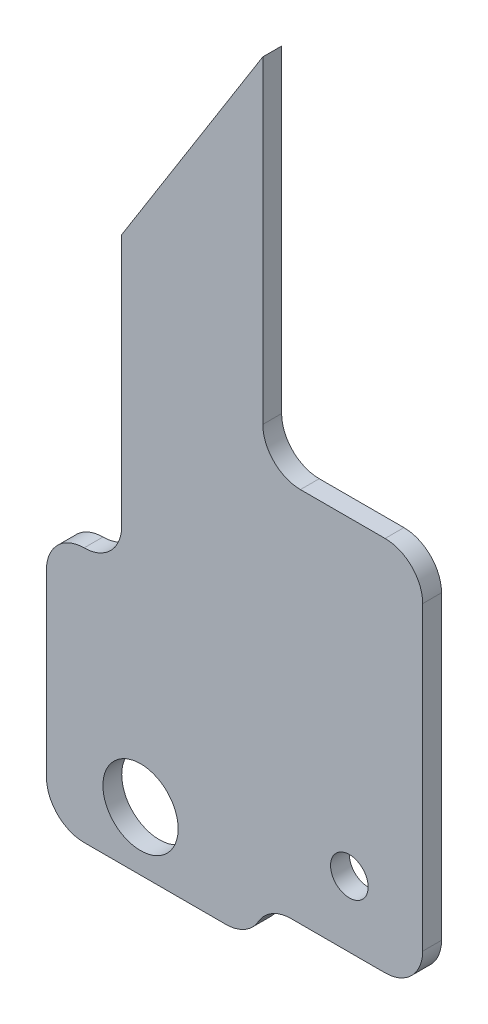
ISO-10303-21;
HEADER;
FILE_DESCRIPTION(('STEP AP214'),'2;1');
FILE_NAME('part.step','',(''),(''),'','','');
FILE_SCHEMA(('AUTOMOTIVE_DESIGN { 1 0 10303 214 1 1 1 1 }'));
ENDSEC;
DATA;
#1=APPLICATION_CONTEXT('core data for automotive mechanical design processes');
#2=APPLICATION_PROTOCOL_DEFINITION('international standard','automotive_design',2000,#1);
#3=PRODUCT_CONTEXT('',#1,'mechanical');
#4=PRODUCT('Part','Part','',(#3));
#5=PRODUCT_RELATED_PRODUCT_CATEGORY('part','',(#4));
#6=PRODUCT_DEFINITION_FORMATION('','',#4);
#7=PRODUCT_DEFINITION_CONTEXT('part definition',#1,'design');
#8=PRODUCT_DEFINITION('design','',#6,#7);
#9=PRODUCT_DEFINITION_SHAPE('','',#8);
#10=(LENGTH_UNIT() NAMED_UNIT(*) SI_UNIT(.MILLI.,.METRE.));
#11=(NAMED_UNIT(*) PLANE_ANGLE_UNIT() SI_UNIT($,.RADIAN.));
#12=(NAMED_UNIT(*) SI_UNIT($,.STERADIAN.) SOLID_ANGLE_UNIT());
#13=UNCERTAINTY_MEASURE_WITH_UNIT(LENGTH_MEASURE(1.E-05),#10,'distance_accuracy_value','');
#14=(GEOMETRIC_REPRESENTATION_CONTEXT(3) GLOBAL_UNCERTAINTY_ASSIGNED_CONTEXT((#13)) GLOBAL_UNIT_ASSIGNED_CONTEXT((#10,
#11,#12)) REPRESENTATION_CONTEXT('',''));
#15=CARTESIAN_POINT('',(0.,0.,0.));
#16=DIRECTION('',(0.,0.,1.));
#17=DIRECTION('',(1.,0.,0.));
#18=AXIS2_PLACEMENT_3D('',#15,#16,#17);
#19=CARTESIAN_POINT('',(-12.6488212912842,16.8678571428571,2.));
#20=DIRECTION('',(-1.,0.,0.));
#21=DIRECTION('',(0.,-1.,0.));
#22=AXIS2_PLACEMENT_3D('',#19,#20,#21);
#23=PLANE('',#22);
#24=DIRECTION('',(0.,1.,0.));
#25=VECTOR('',#24,1.);
#26=CARTESIAN_POINT('',(-12.6488212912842,16.8678571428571,2.));
#27=LINE('',#26,#25);
#28=CARTESIAN_POINT('',(-12.6488212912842,20.8678571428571,2.));
#29=VERTEX_POINT('',#28);
#30=CARTESIAN_POINT('',(-12.6488212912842,54.7093537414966,2.));
#31=VERTEX_POINT('',#30);
#32=EDGE_CURVE('E148',#29,#31,#27,.T.);
#33=ORIENTED_EDGE('',*,*,#32,.F.);
#34=DIRECTION('',(0.,0.,-1.));
#35=VECTOR('',#34,1.);
#36=CARTESIAN_POINT('',(-12.6488212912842,20.8678571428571,0.));
#37=LINE('',#36,#35);
#38=CARTESIAN_POINT('',(-12.6488212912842,20.8678571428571,0.));
#39=VERTEX_POINT('',#38);
#40=EDGE_CURVE('E176',#29,#39,#37,.T.);
#41=ORIENTED_EDGE('',*,*,#40,.T.);
#42=DIRECTION('',(0.,1.,0.));
#43=VECTOR('',#42,1.);
#44=CARTESIAN_POINT('',(-12.6488212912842,16.8678571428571,0.));
#45=LINE('',#44,#43);
#46=CARTESIAN_POINT('',(-12.6488212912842,54.7093537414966,0.));
#47=VERTEX_POINT('',#46);
#48=EDGE_CURVE('E174',#39,#47,#45,.T.);
#49=ORIENTED_EDGE('',*,*,#48,.T.);
#50=DIRECTION('',(0.,0.,-1.));
#51=VECTOR('',#50,1.);
#52=CARTESIAN_POINT('',(-12.6488212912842,54.7093537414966,2.));
#53=LINE('',#52,#51);
#54=EDGE_CURVE('E167',#31,#47,#53,.T.);
#55=ORIENTED_EDGE('',*,*,#54,.F.);
#56=EDGE_LOOP('',(#33,#41,#49,#55));
#57=FACE_BOUND('',#56,.T.);
#58=ADVANCED_FACE('F33',(#57),#23,.F.);
#59=CARTESIAN_POINT('',(-27.6488212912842,30.8428571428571,2.));
#60=DIRECTION('',(0.846665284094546,-0.532125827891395,0.));
#61=DIRECTION('',(0.532125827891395,0.846665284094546,0.));
#62=AXIS2_PLACEMENT_3D('',#59,#60,#61);
#63=PLANE('',#62);
#64=DIRECTION('',(-0.532125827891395,-0.846665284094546,0.));
#65=VECTOR('',#64,1.);
#66=CARTESIAN_POINT('',(-27.6488212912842,30.8428571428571,0.));
#67=LINE('',#66,#65);
#68=CARTESIAN_POINT('',(-27.6488212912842,30.8428571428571,0.));
#69=VERTEX_POINT('',#68);
#70=EDGE_CURVE('E291',#47,#69,#67,.T.);
#71=ORIENTED_EDGE('',*,*,#70,.T.);
#72=DIRECTION('',(0.,0.,-1.));
#73=VECTOR('',#72,1.);
#74=CARTESIAN_POINT('',(-27.6488212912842,30.8428571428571,2.));
#75=LINE('',#74,#73);
#76=CARTESIAN_POINT('',(-27.6488212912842,30.8428571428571,2.));
#77=VERTEX_POINT('',#76);
#78=EDGE_CURVE('E169',#77,#69,#75,.T.);
#79=ORIENTED_EDGE('',*,*,#78,.F.);
#80=DIRECTION('',(-0.532125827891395,-0.846665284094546,0.));
#81=VECTOR('',#80,1.);
#82=CARTESIAN_POINT('',(-27.6488212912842,30.8428571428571,2.));
#83=LINE('',#82,#81);
#84=EDGE_CURVE('E153',#31,#77,#83,.T.);
#85=ORIENTED_EDGE('',*,*,#84,.F.);
#86=ORIENTED_EDGE('',*,*,#54,.T.);
#87=EDGE_LOOP('',(#71,#79,#85,#86));
#88=FACE_BOUND('',#87,.T.);
#89=ADVANCED_FACE('F166',(#88),#63,.F.);
#90=CARTESIAN_POINT('',(-27.6488212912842,0.,2.));
#91=DIRECTION('',(1.,0.,0.));
#92=DIRECTION('',(0.,0.,-1.));
#93=AXIS2_PLACEMENT_3D('',#90,#91,#92);
#94=PLANE('',#93);
#95=DIRECTION('',(0.,-1.,0.));
#96=VECTOR('',#95,1.);
#97=CARTESIAN_POINT('',(-27.6488212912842,0.,0.));
#98=LINE('',#97,#96);
#99=CARTESIAN_POINT('',(-27.6488212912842,4.,0.));
#100=VERTEX_POINT('',#99);
#101=EDGE_CURVE('E278',#69,#100,#98,.T.);
#102=ORIENTED_EDGE('',*,*,#101,.T.);
#103=DIRECTION('',(0.,0.,-1.));
#104=VECTOR('',#103,1.);
#105=CARTESIAN_POINT('',(-27.6488212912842,4.,2.));
#106=LINE('',#105,#104);
#107=CARTESIAN_POINT('',(-27.6488212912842,4.,2.));
#108=VERTEX_POINT('',#107);
#109=EDGE_CURVE('E220',#100,#108,#106,.F.);
#110=ORIENTED_EDGE('',*,*,#109,.T.);
#111=DIRECTION('',(0.,-1.,0.));
#112=VECTOR('',#111,1.);
#113=CARTESIAN_POINT('',(-27.6488212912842,0.,2.));
#114=LINE('',#113,#112);
#115=EDGE_CURVE('E171',#77,#108,#114,.T.);
#116=ORIENTED_EDGE('',*,*,#115,.F.);
#117=ORIENTED_EDGE('',*,*,#78,.T.);
#118=EDGE_LOOP('',(#102,#110,#116,#117));
#119=FACE_BOUND('',#118,.T.);
#120=ADVANCED_FACE('F299',(#119),#94,.F.);
#121=CARTESIAN_POINT('',(-35.6488212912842,-52.8734693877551,2.));
#122=DIRECTION('',(1.,0.,0.));
#123=DIRECTION('',(0.,0.,-1.));
#124=AXIS2_PLACEMENT_3D('',#121,#122,#123);
#125=PLANE('',#124);
#126=DIRECTION('',(0.,-1.,0.));
#127=VECTOR('',#126,1.);
#128=CARTESIAN_POINT('',(-35.6488212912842,-52.8734693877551,0.));
#129=LINE('',#128,#127);
#130=CARTESIAN_POINT('',(-35.6488212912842,-4.,0.));
#131=VERTEX_POINT('',#130);
#132=CARTESIAN_POINT('',(-35.6488212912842,-23.1321428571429,0.));
#133=VERTEX_POINT('',#132);
#134=EDGE_CURVE('E274',#131,#133,#129,.T.);
#135=ORIENTED_EDGE('',*,*,#134,.T.);
#136=DIRECTION('',(0.,0.,1.));
#137=VECTOR('',#136,1.);
#138=CARTESIAN_POINT('',(-35.6488212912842,-23.1321428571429,2.));
#139=LINE('',#138,#137);
#140=CARTESIAN_POINT('',(-35.6488212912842,-23.1321428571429,2.));
#141=VERTEX_POINT('',#140);
#142=EDGE_CURVE('E11',#133,#141,#139,.T.);
#143=ORIENTED_EDGE('',*,*,#142,.T.);
#144=DIRECTION('',(0.,-1.,0.));
#145=VECTOR('',#144,1.);
#146=CARTESIAN_POINT('',(-35.6488212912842,-52.8734693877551,2.));
#147=LINE('',#146,#145);
#148=CARTESIAN_POINT('',(-35.6488212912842,-4.,2.));
#149=VERTEX_POINT('',#148);
#150=EDGE_CURVE('E314',#149,#141,#147,.T.);
#151=ORIENTED_EDGE('',*,*,#150,.F.);
#152=DIRECTION('',(0.,0.,-1.));
#153=VECTOR('',#152,1.);
#154=CARTESIAN_POINT('',(-35.6488212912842,-4.,2.));
#155=LINE('',#154,#153);
#156=EDGE_CURVE('E218',#149,#131,#155,.T.);
#157=ORIENTED_EDGE('',*,*,#156,.T.);
#158=EDGE_LOOP('',(#135,#143,#151,#157));
#159=FACE_BOUND('',#158,.T.);
#160=ADVANCED_FACE('F312',(#159),#125,.F.);
#161=CARTESIAN_POINT('',(-13.6488212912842,-23.1321428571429,2.));
#162=DIRECTION('',(0.,1.,0.));
#163=DIRECTION('',(0.,0.,1.));
#164=AXIS2_PLACEMENT_3D('',#161,#162,#163);
#165=PLANE('',#164);
#166=DIRECTION('',(1.,0.,0.));
#167=VECTOR('',#166,1.);
#168=CARTESIAN_POINT('',(-13.6488212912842,-23.1321428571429,0.));
#169=LINE('',#168,#167);
#170=CARTESIAN_POINT('',(-9.64882129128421,-23.1321428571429,0.));
#171=VERTEX_POINT('',#170);
#172=CARTESIAN_POINT('',(0.351178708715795,-23.1321428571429,0.));
#173=VERTEX_POINT('',#172);
#174=EDGE_CURVE('E269',#171,#173,#169,.T.);
#175=ORIENTED_EDGE('',*,*,#174,.T.);
#176=DIRECTION('',(0.,0.,-1.));
#177=VECTOR('',#176,1.);
#178=CARTESIAN_POINT('',(0.351178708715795,-23.1321428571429,2.));
#179=LINE('',#178,#177);
#180=CARTESIAN_POINT('',(0.351178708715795,-23.1321428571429,2.));
#181=VERTEX_POINT('',#180);
#182=EDGE_CURVE('E216',#173,#181,#179,.F.);
#183=ORIENTED_EDGE('',*,*,#182,.T.);
#184=DIRECTION('',(1.,0.,0.));
#185=VECTOR('',#184,1.);
#186=CARTESIAN_POINT('',(-13.6488212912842,-23.1321428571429,2.));
#187=LINE('',#186,#185);
#188=CARTESIAN_POINT('',(-9.64882129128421,-23.1321428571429,2.));
#189=VERTEX_POINT('',#188);
#190=EDGE_CURVE('E271',#189,#181,#187,.T.);
#191=ORIENTED_EDGE('',*,*,#190,.F.);
#192=DIRECTION('',(0.,0.,-1.));
#193=VECTOR('',#192,1.);
#194=CARTESIAN_POINT('',(-9.64882129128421,-23.1321428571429,0.));
#195=LINE('',#194,#193);
#196=EDGE_CURVE('E213',#189,#171,#195,.T.);
#197=ORIENTED_EDGE('',*,*,#196,.T.);
#198=EDGE_LOOP('',(#175,#183,#191,#197));
#199=FACE_BOUND('',#198,.T.);
#200=ADVANCED_FACE('F268',(#199),#165,.F.);
#201=CARTESIAN_POINT('',(4.3511787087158,-23.1321428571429,2.));
#202=DIRECTION('',(-1.,0.,0.));
#203=DIRECTION('',(0.,0.,1.));
#204=AXIS2_PLACEMENT_3D('',#201,#202,#203);
#205=PLANE('',#204);
#206=DIRECTION('',(0.,1.,0.));
#207=VECTOR('',#206,1.);
#208=CARTESIAN_POINT('',(4.3511787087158,-23.1321428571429,0.));
#209=LINE('',#208,#207);
#210=CARTESIAN_POINT('',(4.3511787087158,-19.1321428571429,0.));
#211=VERTEX_POINT('',#210);
#212=CARTESIAN_POINT('',(4.3511787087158,12.8678571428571,0.));
#213=VERTEX_POINT('',#212);
#214=EDGE_CURVE('E273',#211,#213,#209,.T.);
#215=ORIENTED_EDGE('',*,*,#214,.T.);
#216=DIRECTION('',(0.,0.,-1.));
#217=VECTOR('',#216,1.);
#218=CARTESIAN_POINT('',(4.3511787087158,12.8678571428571,2.));
#219=LINE('',#218,#217);
#220=CARTESIAN_POINT('',(4.3511787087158,12.8678571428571,2.));
#221=VERTEX_POINT('',#220);
#222=EDGE_CURVE('E205',#213,#221,#219,.F.);
#223=ORIENTED_EDGE('',*,*,#222,.T.);
#224=DIRECTION('',(0.,1.,0.));
#225=VECTOR('',#224,1.);
#226=CARTESIAN_POINT('',(4.3511787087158,-23.1321428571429,2.));
#227=LINE('',#226,#225);
#228=CARTESIAN_POINT('',(4.3511787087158,-19.1321428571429,2.));
#229=VERTEX_POINT('',#228);
#230=EDGE_CURVE('E316',#229,#221,#227,.T.);
#231=ORIENTED_EDGE('',*,*,#230,.F.);
#232=DIRECTION('',(0.,0.,-1.));
#233=VECTOR('',#232,1.);
#234=CARTESIAN_POINT('',(4.3511787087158,-19.1321428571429,2.));
#235=LINE('',#234,#233);
#236=EDGE_CURVE('E202',#229,#211,#235,.T.);
#237=ORIENTED_EDGE('',*,*,#236,.T.);
#238=EDGE_LOOP('',(#215,#223,#231,#237));
#239=FACE_BOUND('',#238,.T.);
#240=ADVANCED_FACE('F326',(#239),#205,.F.);
#241=CARTESIAN_POINT('',(4.3511787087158,16.8678571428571,2.));
#242=DIRECTION('',(0.,-1.,0.));
#243=DIRECTION('',(1.,0.,0.));
#244=AXIS2_PLACEMENT_3D('',#241,#242,#243);
#245=PLANE('',#244);
#246=DIRECTION('',(-1.,0.,0.));
#247=VECTOR('',#246,1.);
#248=CARTESIAN_POINT('',(4.3511787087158,16.8678571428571,0.));
#249=LINE('',#248,#247);
#250=CARTESIAN_POINT('',(0.351178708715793,16.8678571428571,0.));
#251=VERTEX_POINT('',#250);
#252=CARTESIAN_POINT('',(-8.6488212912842,16.8678571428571,0.));
#253=VERTEX_POINT('',#252);
#254=EDGE_CURVE('E162',#251,#253,#249,.T.);
#255=ORIENTED_EDGE('',*,*,#254,.T.);
#256=DIRECTION('',(0.,0.,-1.));
#257=VECTOR('',#256,1.);
#258=CARTESIAN_POINT('',(-8.6488212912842,16.8678571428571,2.));
#259=LINE('',#258,#257);
#260=CARTESIAN_POINT('',(-8.6488212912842,16.8678571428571,2.));
#261=VERTEX_POINT('',#260);
#262=EDGE_CURVE('E194',#253,#261,#259,.F.);
#263=ORIENTED_EDGE('',*,*,#262,.T.);
#264=DIRECTION('',(-1.,0.,0.));
#265=VECTOR('',#264,1.);
#266=CARTESIAN_POINT('',(4.3511787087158,16.8678571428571,2.));
#267=LINE('',#266,#265);
#268=CARTESIAN_POINT('',(0.351178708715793,16.8678571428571,2.));
#269=VERTEX_POINT('',#268);
#270=EDGE_CURVE('E180',#269,#261,#267,.T.);
#271=ORIENTED_EDGE('',*,*,#270,.F.);
#272=DIRECTION('',(0.,0.,-1.));
#273=VECTOR('',#272,1.);
#274=CARTESIAN_POINT('',(0.351178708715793,16.8678571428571,2.));
#275=LINE('',#274,#273);
#276=EDGE_CURVE('E178',#269,#251,#275,.T.);
#277=ORIENTED_EDGE('',*,*,#276,.T.);
#278=EDGE_LOOP('',(#255,#263,#271,#277));
#279=FACE_BOUND('',#278,.T.);
#280=ADVANCED_FACE('F285',(#279),#245,.F.);
#281=CARTESIAN_POINT('',(0.,0.,2.));
#282=DIRECTION('',(0.,0.,-1.));
#283=DIRECTION('',(-1.,0.,0.));
#284=AXIS2_PLACEMENT_3D('',#281,#282,#283);
#285=PLANE('',#284);
#286=CARTESIAN_POINT('',(-25.6488212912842,-20.8734693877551,2.));
#287=DIRECTION('',(0.,0.,1.));
#288=DIRECTION('',(1.,0.,0.));
#289=AXIS2_PLACEMENT_3D('',#286,#287,#288);
#290=CIRCLE('',#289,4.);
#291=CARTESIAN_POINT('',(-21.6488212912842,-20.8734693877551,2.));
#292=VERTEX_POINT('',#291);
#293=EDGE_CURVE('E190',#292,#292,#290,.T.);
#294=ORIENTED_EDGE('',*,*,#293,.F.);
#295=EDGE_LOOP('',(#294));
#296=FACE_BOUND('',#295,.T.);
#297=CARTESIAN_POINT('',(-3.4488212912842,-16.1321428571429,2.));
#298=DIRECTION('',(0.,0.,1.));
#299=DIRECTION('',(1.,0.,0.));
#300=AXIS2_PLACEMENT_3D('',#297,#298,#299);
#301=CIRCLE('',#300,1.99999999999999);
#302=CARTESIAN_POINT('',(-1.44882129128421,-16.1321428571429,2.));
#303=VERTEX_POINT('',#302);
#304=EDGE_CURVE('E187',#303,#303,#301,.T.);
#305=ORIENTED_EDGE('',*,*,#304,.F.);
#306=EDGE_LOOP('',(#305));
#307=FACE_BOUND('',#306,.T.);
#308=DIRECTION('',(-1.,0.,0.));
#309=VECTOR('',#308,1.);
#310=CARTESIAN_POINT('',(-13.6488212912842,-27.1321428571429,2.));
#311=LINE('',#310,#309);
#312=CARTESIAN_POINT('',(-16.5770245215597,-27.1321428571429,2.));
#313=VERTEX_POINT('',#312);
#314=CARTESIAN_POINT('',(-31.6488212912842,-27.1321428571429,2.));
#315=VERTEX_POINT('',#314);
#316=EDGE_CURVE('E259',#313,#315,#311,.T.);
#317=ORIENTED_EDGE('',*,*,#316,.F.);
#318=CARTESIAN_POINT('',(-16.5770245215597,-23.1321428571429,2.));
#319=DIRECTION('',(0.,0.,-1.));
#320=DIRECTION('',(-1.,0.,0.));
#321=AXIS2_PLACEMENT_3D('',#318,#319,#320);
#322=CIRCLE('',#321,4.);
#323=CARTESIAN_POINT('',(-13.112922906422,-25.1321428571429,2.));
#324=VERTEX_POINT('',#323);
#325=EDGE_CURVE('E245',#313,#324,#322,.F.);
#326=ORIENTED_EDGE('',*,*,#325,.T.);
#327=CARTESIAN_POINT('',(-9.64882129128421,-27.1321428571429,2.));
#328=DIRECTION('',(0.,0.,-1.));
#329=DIRECTION('',(-1.,0.,0.));
#330=AXIS2_PLACEMENT_3D('',#327,#328,#329);
#331=CIRCLE('',#330,4.);
#332=EDGE_CURVE('E228',#324,#189,#331,.T.);
#333=ORIENTED_EDGE('',*,*,#332,.T.);
#334=ORIENTED_EDGE('',*,*,#190,.T.);
#335=CARTESIAN_POINT('',(0.351178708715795,-19.1321428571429,2.));
#336=DIRECTION('',(0.,0.,-1.));
#337=DIRECTION('',(-1.,0.,0.));
#338=AXIS2_PLACEMENT_3D('',#335,#336,#337);
#339=CIRCLE('',#338,4.);
#340=EDGE_CURVE('E209',#181,#229,#339,.F.);
#341=ORIENTED_EDGE('',*,*,#340,.T.);
#342=ORIENTED_EDGE('',*,*,#230,.T.);
#343=CARTESIAN_POINT('',(0.351178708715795,12.8678571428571,2.));
#344=DIRECTION('',(0.,0.,-1.));
#345=DIRECTION('',(-1.,0.,0.));
#346=AXIS2_PLACEMENT_3D('',#343,#344,#345);
#347=CIRCLE('',#346,4.);
#348=EDGE_CURVE('E211',#221,#269,#347,.F.);
#349=ORIENTED_EDGE('',*,*,#348,.T.);
#350=ORIENTED_EDGE('',*,*,#270,.T.);
#351=CARTESIAN_POINT('',(-8.6488212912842,20.8678571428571,2.));
#352=DIRECTION('',(0.,0.,-1.));
#353=DIRECTION('',(-1.,0.,0.));
#354=AXIS2_PLACEMENT_3D('',#351,#352,#353);
#355=CIRCLE('',#354,4.);
#356=EDGE_CURVE('E157',#261,#29,#355,.T.);
#357=ORIENTED_EDGE('',*,*,#356,.T.);
#358=ORIENTED_EDGE('',*,*,#32,.T.);
#359=ORIENTED_EDGE('',*,*,#84,.T.);
#360=ORIENTED_EDGE('',*,*,#115,.T.);
#361=CARTESIAN_POINT('',(-31.6488212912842,4.,2.));
#362=DIRECTION('',(0.,0.,-1.));
#363=DIRECTION('',(-1.,0.,0.));
#364=AXIS2_PLACEMENT_3D('',#361,#362,#363);
#365=CIRCLE('',#364,4.);
#366=CARTESIAN_POINT('',(-31.6488212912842,0.,2.));
#367=VERTEX_POINT('',#366);
#368=EDGE_CURVE('E232',#108,#367,#365,.T.);
#369=ORIENTED_EDGE('',*,*,#368,.T.);
#370=CARTESIAN_POINT('',(-31.6488212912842,-4.,2.));
#371=DIRECTION('',(0.,0.,-1.));
#372=DIRECTION('',(-1.,0.,0.));
#373=AXIS2_PLACEMENT_3D('',#370,#371,#372);
#374=CIRCLE('',#373,4.);
#375=EDGE_CURVE('E207',#367,#149,#374,.F.);
#376=ORIENTED_EDGE('',*,*,#375,.T.);
#377=ORIENTED_EDGE('',*,*,#150,.T.);
#378=CARTESIAN_POINT('',(-31.6488212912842,-23.1321428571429,2.));
#379=DIRECTION('',(0.,0.,-1.));
#380=DIRECTION('',(-1.,0.,0.));
#381=AXIS2_PLACEMENT_3D('',#378,#379,#380);
#382=CIRCLE('',#381,4.);
#383=EDGE_CURVE('E243',#141,#315,#382,.F.);
#384=ORIENTED_EDGE('',*,*,#383,.T.);
#385=EDGE_LOOP('',(#317,#326,#333,#334,#341,#342,#349,#350,#357,#358,#359,#360,#369,#376,#377,#384));
#386=FACE_BOUND('',#385,.T.);
#387=ADVANCED_FACE('F151',(#296,#307,#386),#285,.F.);
#388=CARTESIAN_POINT('',(0.,0.,0.));
#389=DIRECTION('',(0.,0.,-1.));
#390=DIRECTION('',(-1.,0.,0.));
#391=AXIS2_PLACEMENT_3D('',#388,#389,#390);
#392=PLANE('',#391);
#393=CARTESIAN_POINT('',(-9.64882129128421,-27.1321428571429,0.));
#394=DIRECTION('',(0.,0.,-1.));
#395=DIRECTION('',(-1.,0.,0.));
#396=AXIS2_PLACEMENT_3D('',#393,#394,#395);
#397=CIRCLE('',#396,4.);
#398=CARTESIAN_POINT('',(-13.112922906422,-25.1321428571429,0.));
#399=VERTEX_POINT('',#398);
#400=EDGE_CURVE('E226',#171,#399,#397,.F.);
#401=ORIENTED_EDGE('',*,*,#400,.T.);
#402=CARTESIAN_POINT('',(-16.5770245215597,-23.1321428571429,0.));
#403=DIRECTION('',(0.,0.,-1.));
#404=DIRECTION('',(-1.,0.,0.));
#405=AXIS2_PLACEMENT_3D('',#402,#403,#404);
#406=CIRCLE('',#405,4.);
#407=CARTESIAN_POINT('',(-16.5770245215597,-27.1321428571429,0.));
#408=VERTEX_POINT('',#407);
#409=EDGE_CURVE('E41',#399,#408,#406,.T.);
#410=ORIENTED_EDGE('',*,*,#409,.T.);
#411=DIRECTION('',(-1.,0.,0.));
#412=VECTOR('',#411,1.);
#413=CARTESIAN_POINT('',(-13.6488212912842,-27.1321428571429,0.));
#414=LINE('',#413,#412);
#415=CARTESIAN_POINT('',(-31.6488212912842,-27.1321428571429,0.));
#416=VERTEX_POINT('',#415);
#417=EDGE_CURVE('E238',#408,#416,#414,.T.);
#418=ORIENTED_EDGE('',*,*,#417,.T.);
#419=CARTESIAN_POINT('',(-31.6488212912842,-23.1321428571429,0.));
#420=DIRECTION('',(0.,0.,-1.));
#421=DIRECTION('',(-1.,0.,0.));
#422=AXIS2_PLACEMENT_3D('',#419,#420,#421);
#423=CIRCLE('',#422,4.);
#424=EDGE_CURVE('E48',#416,#133,#423,.T.);
#425=ORIENTED_EDGE('',*,*,#424,.T.);
#426=ORIENTED_EDGE('',*,*,#134,.F.);
#427=CARTESIAN_POINT('',(-31.6488212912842,-4.,0.));
#428=DIRECTION('',(0.,0.,-1.));
#429=DIRECTION('',(-1.,0.,0.));
#430=AXIS2_PLACEMENT_3D('',#427,#428,#429);
#431=CIRCLE('',#430,4.);
#432=CARTESIAN_POINT('',(-31.6488212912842,0.,0.));
#433=VERTEX_POINT('',#432);
#434=EDGE_CURVE('E196',#131,#433,#431,.T.);
#435=ORIENTED_EDGE('',*,*,#434,.T.);
#436=CARTESIAN_POINT('',(-31.6488212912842,4.,0.));
#437=DIRECTION('',(0.,0.,-1.));
#438=DIRECTION('',(-1.,0.,0.));
#439=AXIS2_PLACEMENT_3D('',#436,#437,#438);
#440=CIRCLE('',#439,4.);
#441=EDGE_CURVE('E230',#433,#100,#440,.F.);
#442=ORIENTED_EDGE('',*,*,#441,.T.);
#443=ORIENTED_EDGE('',*,*,#101,.F.);
#444=ORIENTED_EDGE('',*,*,#70,.F.);
#445=ORIENTED_EDGE('',*,*,#48,.F.);
#446=CARTESIAN_POINT('',(-8.6488212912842,20.8678571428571,0.));
#447=DIRECTION('',(0.,0.,-1.));
#448=DIRECTION('',(-1.,0.,0.));
#449=AXIS2_PLACEMENT_3D('',#446,#447,#448);
#450=CIRCLE('',#449,4.);
#451=EDGE_CURVE('E223',#39,#253,#450,.F.);
#452=ORIENTED_EDGE('',*,*,#451,.T.);
#453=ORIENTED_EDGE('',*,*,#254,.F.);
#454=CARTESIAN_POINT('',(0.351178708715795,12.8678571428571,0.));
#455=DIRECTION('',(0.,0.,-1.));
#456=DIRECTION('',(-1.,0.,0.));
#457=AXIS2_PLACEMENT_3D('',#454,#455,#456);
#458=CIRCLE('',#457,4.);
#459=EDGE_CURVE('E200',#251,#213,#458,.T.);
#460=ORIENTED_EDGE('',*,*,#459,.T.);
#461=ORIENTED_EDGE('',*,*,#214,.F.);
#462=CARTESIAN_POINT('',(0.351178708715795,-19.1321428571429,0.));
#463=DIRECTION('',(0.,0.,-1.));
#464=DIRECTION('',(-1.,0.,0.));
#465=AXIS2_PLACEMENT_3D('',#462,#463,#464);
#466=CIRCLE('',#465,4.);
#467=EDGE_CURVE('E198',#211,#173,#466,.T.);
#468=ORIENTED_EDGE('',*,*,#467,.T.);
#469=ORIENTED_EDGE('',*,*,#174,.F.);
#470=EDGE_LOOP('',(#401,#410,#418,#425,#426,#435,#442,#443,#444,#445,#452,#453,#460,#461,#468,#469));
#471=FACE_BOUND('',#470,.T.);
#472=CARTESIAN_POINT('',(-25.6488212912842,-20.8734693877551,0.));
#473=DIRECTION('',(0.,0.,-1.));
#474=DIRECTION('',(-1.,0.,0.));
#475=AXIS2_PLACEMENT_3D('',#472,#473,#474);
#476=CIRCLE('',#475,4.);
#477=CARTESIAN_POINT('',(-29.6488212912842,-20.8734693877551,0.));
#478=VERTEX_POINT('',#477);
#479=EDGE_CURVE('E188',#478,#478,#476,.T.);
#480=ORIENTED_EDGE('',*,*,#479,.F.);
#481=EDGE_LOOP('',(#480));
#482=FACE_BOUND('',#481,.T.);
#483=CARTESIAN_POINT('',(-3.4488212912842,-16.1321428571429,0.));
#484=DIRECTION('',(0.,0.,-1.));
#485=DIRECTION('',(-1.,0.,0.));
#486=AXIS2_PLACEMENT_3D('',#483,#484,#485);
#487=CIRCLE('',#486,1.99999999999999);
#488=CARTESIAN_POINT('',(-5.44882129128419,-16.1321428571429,0.));
#489=VERTEX_POINT('',#488);
#490=EDGE_CURVE('E184',#489,#489,#487,.T.);
#491=ORIENTED_EDGE('',*,*,#490,.F.);
#492=EDGE_LOOP('',(#491));
#493=FACE_BOUND('',#492,.T.);
#494=ADVANCED_FACE('F250',(#471,#482,#493),#392,.T.);
#495=CARTESIAN_POINT('',(-3.4488212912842,-16.1321428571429,2.));
#496=DIRECTION('',(0.,0.,1.));
#497=DIRECTION('',(1.,0.,0.));
#498=AXIS2_PLACEMENT_3D('',#495,#496,#497);
#499=CYLINDRICAL_SURFACE('',#498,1.99999999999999);
#500=ORIENTED_EDGE('',*,*,#490,.T.);
#501=EDGE_LOOP('',(#500));
#502=FACE_BOUND('',#501,.T.);
#503=ORIENTED_EDGE('',*,*,#304,.T.);
#504=EDGE_LOOP('',(#503));
#505=FACE_BOUND('',#504,.T.);
#506=ADVANCED_FACE('F353',(#502,#505),#499,.F.);
#507=CARTESIAN_POINT('',(-25.6488212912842,-20.8734693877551,2.));
#508=DIRECTION('',(0.,0.,1.));
#509=DIRECTION('',(1.,0.,0.));
#510=AXIS2_PLACEMENT_3D('',#507,#508,#509);
#511=CYLINDRICAL_SURFACE('',#510,4.);
#512=ORIENTED_EDGE('',*,*,#479,.T.);
#513=EDGE_LOOP('',(#512));
#514=FACE_BOUND('',#513,.T.);
#515=ORIENTED_EDGE('',*,*,#293,.T.);
#516=EDGE_LOOP('',(#515));
#517=FACE_BOUND('',#516,.T.);
#518=ADVANCED_FACE('F349',(#514,#517),#511,.F.);
#519=CARTESIAN_POINT('',(-8.6488212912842,20.8678571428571,2.));
#520=DIRECTION('',(0.,0.,1.));
#521=DIRECTION('',(1.,0.,0.));
#522=AXIS2_PLACEMENT_3D('',#519,#520,#521);
#523=CYLINDRICAL_SURFACE('',#522,4.);
#524=ORIENTED_EDGE('',*,*,#356,.F.);
#525=ORIENTED_EDGE('',*,*,#262,.F.);
#526=ORIENTED_EDGE('',*,*,#451,.F.);
#527=ORIENTED_EDGE('',*,*,#40,.F.);
#528=EDGE_LOOP('',(#524,#525,#526,#527));
#529=FACE_BOUND('',#528,.T.);
#530=ADVANCED_FACE('F289',(#529),#523,.F.);
#531=CARTESIAN_POINT('',(0.351178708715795,12.8678571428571,2.));
#532=DIRECTION('',(0.,0.,-1.));
#533=DIRECTION('',(-1.,0.,0.));
#534=AXIS2_PLACEMENT_3D('',#531,#532,#533);
#535=CYLINDRICAL_SURFACE('',#534,4.);
#536=ORIENTED_EDGE('',*,*,#348,.F.);
#537=ORIENTED_EDGE('',*,*,#222,.F.);
#538=ORIENTED_EDGE('',*,*,#459,.F.);
#539=ORIENTED_EDGE('',*,*,#276,.F.);
#540=EDGE_LOOP('',(#536,#537,#538,#539));
#541=FACE_BOUND('',#540,.T.);
#542=ADVANCED_FACE('F323',(#541),#535,.T.);
#543=CARTESIAN_POINT('',(0.351178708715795,-19.1321428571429,2.));
#544=DIRECTION('',(0.,0.,-1.));
#545=DIRECTION('',(-1.,0.,0.));
#546=AXIS2_PLACEMENT_3D('',#543,#544,#545);
#547=CYLINDRICAL_SURFACE('',#546,4.);
#548=ORIENTED_EDGE('',*,*,#340,.F.);
#549=ORIENTED_EDGE('',*,*,#182,.F.);
#550=ORIENTED_EDGE('',*,*,#467,.F.);
#551=ORIENTED_EDGE('',*,*,#236,.F.);
#552=EDGE_LOOP('',(#548,#549,#550,#551));
#553=FACE_BOUND('',#552,.T.);
#554=ADVANCED_FACE('F330',(#553),#547,.T.);
#555=CARTESIAN_POINT('',(-9.64882129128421,-27.1321428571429,2.));
#556=DIRECTION('',(0.,0.,1.));
#557=DIRECTION('',(1.,0.,0.));
#558=AXIS2_PLACEMENT_3D('',#555,#556,#557);
#559=CYLINDRICAL_SURFACE('',#558,4.);
#560=ORIENTED_EDGE('',*,*,#332,.F.);
#561=DIRECTION('',(0.,0.,1.));
#562=VECTOR('',#561,1.);
#563=CARTESIAN_POINT('',(-13.112922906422,-25.1321428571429,2.));
#564=LINE('',#563,#562);
#565=EDGE_CURVE('E56',#324,#399,#564,.F.);
#566=ORIENTED_EDGE('',*,*,#565,.T.);
#567=ORIENTED_EDGE('',*,*,#400,.F.);
#568=ORIENTED_EDGE('',*,*,#196,.F.);
#569=EDGE_LOOP('',(#560,#566,#567,#568));
#570=FACE_BOUND('',#569,.T.);
#571=ADVANCED_FACE('F265',(#570),#559,.F.);
#572=CARTESIAN_POINT('',(-31.6488212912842,-4.,2.));
#573=DIRECTION('',(0.,0.,-1.));
#574=DIRECTION('',(-1.,0.,0.));
#575=AXIS2_PLACEMENT_3D('',#572,#573,#574);
#576=CYLINDRICAL_SURFACE('',#575,4.);
#577=ORIENTED_EDGE('',*,*,#156,.F.);
#578=ORIENTED_EDGE('',*,*,#375,.F.);
#579=DIRECTION('',(0.,0.,-1.));
#580=VECTOR('',#579,1.);
#581=CARTESIAN_POINT('',(-31.6488212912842,0.,2.));
#582=LINE('',#581,#580);
#583=EDGE_CURVE('E235',#433,#367,#582,.F.);
#584=ORIENTED_EDGE('',*,*,#583,.F.);
#585=ORIENTED_EDGE('',*,*,#434,.F.);
#586=EDGE_LOOP('',(#577,#578,#584,#585));
#587=FACE_BOUND('',#586,.T.);
#588=ADVANCED_FACE('F309',(#587),#576,.T.);
#589=CARTESIAN_POINT('',(-31.6488212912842,4.,2.));
#590=DIRECTION('',(0.,0.,1.));
#591=DIRECTION('',(1.,0.,0.));
#592=AXIS2_PLACEMENT_3D('',#589,#590,#591);
#593=CYLINDRICAL_SURFACE('',#592,4.);
#594=ORIENTED_EDGE('',*,*,#368,.F.);
#595=ORIENTED_EDGE('',*,*,#109,.F.);
#596=ORIENTED_EDGE('',*,*,#441,.F.);
#597=ORIENTED_EDGE('',*,*,#583,.T.);
#598=EDGE_LOOP('',(#594,#595,#596,#597));
#599=FACE_BOUND('',#598,.T.);
#600=ADVANCED_FACE('F302',(#599),#593,.F.);
#601=CARTESIAN_POINT('',(-13.6488212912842,-27.1321428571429,0.));
#602=DIRECTION('',(0.,1.,0.));
#603=DIRECTION('',(0.,0.,1.));
#604=AXIS2_PLACEMENT_3D('',#601,#602,#603);
#605=PLANE('',#604);
#606=ORIENTED_EDGE('',*,*,#417,.F.);
#607=DIRECTION('',(0.,0.,1.));
#608=VECTOR('',#607,1.);
#609=CARTESIAN_POINT('',(-16.5770245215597,-27.1321428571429,0.));
#610=LINE('',#609,#608);
#611=EDGE_CURVE('E240',#408,#313,#610,.T.);
#612=ORIENTED_EDGE('',*,*,#611,.T.);
#613=ORIENTED_EDGE('',*,*,#316,.T.);
#614=DIRECTION('',(0.,0.,1.));
#615=VECTOR('',#614,1.);
#616=CARTESIAN_POINT('',(-31.6488212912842,-27.1321428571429,0.));
#617=LINE('',#616,#615);
#618=EDGE_CURVE('E234',#315,#416,#617,.F.);
#619=ORIENTED_EDGE('',*,*,#618,.T.);
#620=EDGE_LOOP('',(#606,#612,#613,#619));
#621=FACE_BOUND('',#620,.T.);
#622=ADVANCED_FACE('F256',(#621),#605,.F.);
#623=CARTESIAN_POINT('',(-16.5770245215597,-23.1321428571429,2.));
#624=DIRECTION('',(0.,0.,1.));
#625=DIRECTION('',(1.,0.,0.));
#626=AXIS2_PLACEMENT_3D('',#623,#624,#625);
#627=CYLINDRICAL_SURFACE('',#626,4.);
#628=ORIENTED_EDGE('',*,*,#409,.F.);
#629=ORIENTED_EDGE('',*,*,#565,.F.);
#630=ORIENTED_EDGE('',*,*,#325,.F.);
#631=ORIENTED_EDGE('',*,*,#611,.F.);
#632=EDGE_LOOP('',(#628,#629,#630,#631));
#633=FACE_BOUND('',#632,.T.);
#634=ADVANCED_FACE('F261',(#633),#627,.T.);
#635=CARTESIAN_POINT('',(-31.6488212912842,-23.1321428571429,2.));
#636=DIRECTION('',(0.,0.,1.));
#637=DIRECTION('',(1.,0.,0.));
#638=AXIS2_PLACEMENT_3D('',#635,#636,#637);
#639=CYLINDRICAL_SURFACE('',#638,4.);
#640=ORIENTED_EDGE('',*,*,#424,.F.);
#641=ORIENTED_EDGE('',*,*,#618,.F.);
#642=ORIENTED_EDGE('',*,*,#383,.F.);
#643=ORIENTED_EDGE('',*,*,#142,.F.);
#644=EDGE_LOOP('',(#640,#641,#642,#643));
#645=FACE_BOUND('',#644,.T.);
#646=ADVANCED_FACE('F35',(#645),#639,.T.);
#647=CLOSED_SHELL('',(#58,#89,#120,#160,#200,#240,#280,#387,#494,#506,#518,#530,#542,#554,#571,
#588,#600,#622,#634,#646));
#648=MANIFOLD_SOLID_BREP('B2',#647);
#649=ADVANCED_BREP_SHAPE_REPRESENTATION('',(#18,#648),#14);
#650=SHAPE_DEFINITION_REPRESENTATION(#9,#649);
ENDSEC;
END-ISO-10303-21;
